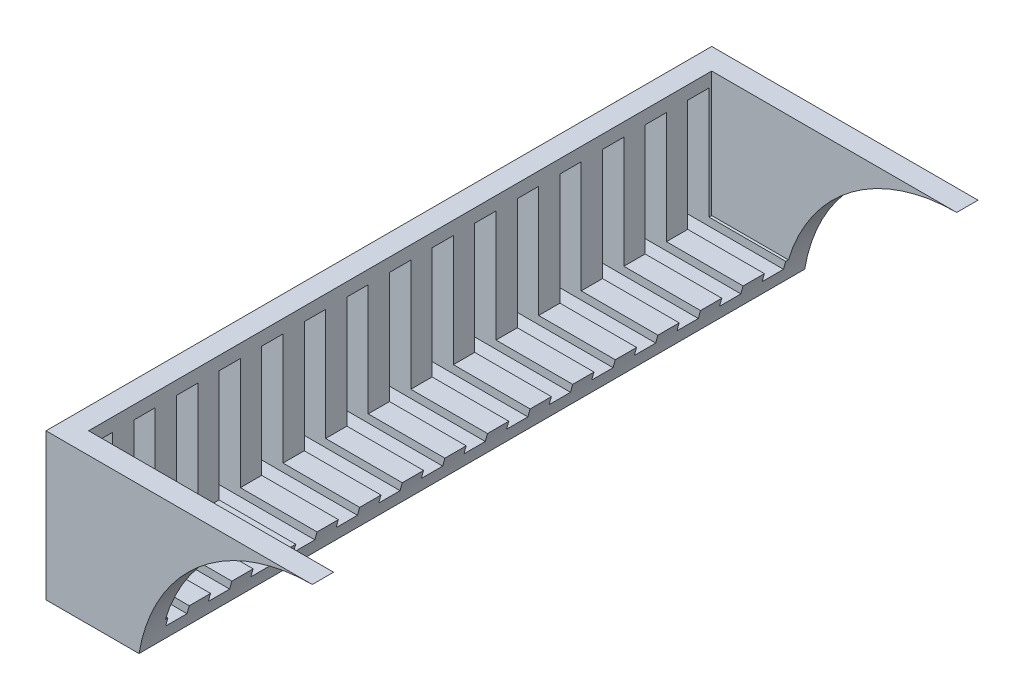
from build123d import *

# Parameters (mm, degrees)
SKETCH1_W               = 127
SKETCH1_H               = 69.85
BOSS_EXTRUDE1_DEPTH     = 317.5
SKETCH2_W               = 116.84
SKETCH2_H               = 297.18
CUT_EXTRUDE1_DEPTH      = 59.69
CUT_EXTRUDE3_DEPTH      = 350.019014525
CUT_EXTRUDE4_REACH      = 351.019
CUT_EXTRUDE4_END_RADIUS = 83.82
SKETCH5_W               = 10.16
SKETCH5_H               = 57.15


with BuildPart() as part:
    # Sketch1 → Boss-Extrude1 (new body)
    with BuildSketch(Plane.XY):
        with Locations((63.5, 34.925)):
            Rectangle(SKETCH1_W, SKETCH1_H)
    extrude(amount=-BOSS_EXTRUDE1_DEPTH)

    # Sketch2 → Cut-Extrude1 (cut)
    with BuildSketch(Plane(origin=(0, 69.85, 0), x_dir=(1, 0, 0), z_dir=(0, 1, 0))):
        with Locations((68.58, 158.75)):
            Rectangle(SKETCH2_W, SKETCH2_H)
    extrude(amount=-CUT_EXTRUDE1_DEPTH, mode=Mode.SUBTRACT)

    # Sketch4 → Cut-Extrude3 (cut, through all)
    with BuildSketch(Plane.XY):
        with BuildLine():
            Line((127, 0), (44.35236543, 0))
            ThreePointArc((44.35236543, 0), (72.894422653, 50.048582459), (127, 69.85))
            Line((127, 69.85), (127, 0))
        make_face()
    extrude(amount=-CUT_EXTRUDE3_DEPTH, mode=Mode.SUBTRACT)

    # Cut-Extrude4: up to this cylinder (the profile starts outside it)
    cut_extrude4_end = Plane(origin=(127, -13.97, -158.75), z_dir=(0, 0, 1)) * Cylinder(CUT_EXTRUDE4_END_RADIUS, 1155.158, mode=Mode.PRIVATE)
    # Sketch5 → Cut-Extrude4 (cut, up to the surface)
    with BuildSketch(Plane.ZY, mode=Mode.PRIVATE) as cut_extrude4_sk1:
        with Locations((-300.99, 34.925)):
            Rectangle(SKETCH5_W, SKETCH5_H)
    cut_extrude4_tool1 = extrude(cut_extrude4_sk1.sketch, amount=-CUT_EXTRUDE4_REACH, mode=Mode.PRIVATE) - cut_extrude4_end
    add(cut_extrude4_tool1.solids().sort_by_distance((0, 34.925, -300.99))[0], mode=Mode.SUBTRACT)
    # Sketch5 → Cut-Extrude4 (cut, up to the surface)
    with BuildSketch(Plane.ZY, mode=Mode.PRIVATE) as cut_extrude4_sk2:
        with Locations((-280.67, 34.925)):
            Rectangle(SKETCH5_W, SKETCH5_H)
    cut_extrude4_tool2 = extrude(cut_extrude4_sk2.sketch, amount=-CUT_EXTRUDE4_REACH, mode=Mode.PRIVATE) - cut_extrude4_end
    add(cut_extrude4_tool2.solids().sort_by_distance((0, 34.925, -280.67))[0], mode=Mode.SUBTRACT)
    # Sketch5 → Cut-Extrude4 (cut, up to the surface)
    with BuildSketch(Plane.ZY, mode=Mode.PRIVATE) as cut_extrude4_sk3:
        with Locations((-260.35, 34.925)):
            Rectangle(SKETCH5_W, SKETCH5_H)
    cut_extrude4_tool3 = extrude(cut_extrude4_sk3.sketch, amount=-CUT_EXTRUDE4_REACH, mode=Mode.PRIVATE) - cut_extrude4_end
    add(cut_extrude4_tool3.solids().sort_by_distance((0, 34.925, -260.35))[0], mode=Mode.SUBTRACT)
    # Sketch5 → Cut-Extrude4 (cut, up to the surface)
    with BuildSketch(Plane.ZY, mode=Mode.PRIVATE) as cut_extrude4_sk4:
        with Locations((-240.03, 34.925)):
            Rectangle(SKETCH5_W, SKETCH5_H)
    cut_extrude4_tool4 = extrude(cut_extrude4_sk4.sketch, amount=-CUT_EXTRUDE4_REACH, mode=Mode.PRIVATE) - cut_extrude4_end
    add(cut_extrude4_tool4.solids().sort_by_distance((0, 34.925, -240.03))[0], mode=Mode.SUBTRACT)
    # Sketch5 → Cut-Extrude4 (cut, up to the surface)
    with BuildSketch(Plane.ZY, mode=Mode.PRIVATE) as cut_extrude4_sk5:
        with Locations((-219.71, 34.925)):
            Rectangle(SKETCH5_W, SKETCH5_H)
    cut_extrude4_tool5 = extrude(cut_extrude4_sk5.sketch, amount=-CUT_EXTRUDE4_REACH, mode=Mode.PRIVATE) - cut_extrude4_end
    add(cut_extrude4_tool5.solids().sort_by_distance((0, 34.925, -219.71))[0], mode=Mode.SUBTRACT)
    # Sketch5 → Cut-Extrude4 (cut, up to the surface)
    with BuildSketch(Plane.ZY, mode=Mode.PRIVATE) as cut_extrude4_sk6:
        with Locations((-199.39, 34.925)):
            Rectangle(SKETCH5_W, SKETCH5_H)
    cut_extrude4_tool6 = extrude(cut_extrude4_sk6.sketch, amount=-CUT_EXTRUDE4_REACH, mode=Mode.PRIVATE) - cut_extrude4_end
    add(cut_extrude4_tool6.solids().sort_by_distance((0, 34.925, -199.39))[0], mode=Mode.SUBTRACT)
    # Sketch5 → Cut-Extrude4 (cut, up to the surface)
    with BuildSketch(Plane.ZY, mode=Mode.PRIVATE) as cut_extrude4_sk7:
        with Locations((-179.07, 34.925)):
            Rectangle(SKETCH5_W, SKETCH5_H)
    cut_extrude4_tool7 = extrude(cut_extrude4_sk7.sketch, amount=-CUT_EXTRUDE4_REACH, mode=Mode.PRIVATE) - cut_extrude4_end
    add(cut_extrude4_tool7.solids().sort_by_distance((0, 34.925, -179.07))[0], mode=Mode.SUBTRACT)
    # Sketch5 → Cut-Extrude4 (cut, up to the surface)
    with BuildSketch(Plane.ZY, mode=Mode.PRIVATE) as cut_extrude4_sk8:
        with Locations((-158.75, 34.925)):
            Rectangle(SKETCH5_W, SKETCH5_H)
    cut_extrude4_tool8 = extrude(cut_extrude4_sk8.sketch, amount=-CUT_EXTRUDE4_REACH, mode=Mode.PRIVATE) - cut_extrude4_end
    add(cut_extrude4_tool8.solids().sort_by_distance((0, 34.925, -158.75))[0], mode=Mode.SUBTRACT)
    # Sketch5 → Cut-Extrude4 (cut, up to the surface)
    with BuildSketch(Plane.ZY, mode=Mode.PRIVATE) as cut_extrude4_sk9:
        with Locations((-138.43, 34.925)):
            Rectangle(SKETCH5_W, SKETCH5_H)
    cut_extrude4_tool9 = extrude(cut_extrude4_sk9.sketch, amount=-CUT_EXTRUDE4_REACH, mode=Mode.PRIVATE) - cut_extrude4_end
    add(cut_extrude4_tool9.solids().sort_by_distance((0, 34.925, -138.43))[0], mode=Mode.SUBTRACT)
    # Sketch5 → Cut-Extrude4 (cut, up to the surface)
    with BuildSketch(Plane.ZY, mode=Mode.PRIVATE) as cut_extrude4_sk10:
        with Locations((-118.11, 34.925)):
            Rectangle(SKETCH5_W, SKETCH5_H)
    cut_extrude4_tool10 = extrude(cut_extrude4_sk10.sketch, amount=-CUT_EXTRUDE4_REACH, mode=Mode.PRIVATE) - cut_extrude4_end
    add(cut_extrude4_tool10.solids().sort_by_distance((0, 34.925, -118.11))[0], mode=Mode.SUBTRACT)
    # Sketch5 → Cut-Extrude4 (cut, up to the surface)
    with BuildSketch(Plane.ZY, mode=Mode.PRIVATE) as cut_extrude4_sk11:
        with Locations((-97.79, 34.925)):
            Rectangle(SKETCH5_W, SKETCH5_H)
    cut_extrude4_tool11 = extrude(cut_extrude4_sk11.sketch, amount=-CUT_EXTRUDE4_REACH, mode=Mode.PRIVATE) - cut_extrude4_end
    add(cut_extrude4_tool11.solids().sort_by_distance((0, 34.925, -97.79))[0], mode=Mode.SUBTRACT)
    # Sketch5 → Cut-Extrude4 (cut, up to the surface)
    with BuildSketch(Plane.ZY, mode=Mode.PRIVATE) as cut_extrude4_sk12:
        with Locations((-77.47, 34.925)):
            Rectangle(SKETCH5_W, SKETCH5_H)
    cut_extrude4_tool12 = extrude(cut_extrude4_sk12.sketch, amount=-CUT_EXTRUDE4_REACH, mode=Mode.PRIVATE) - cut_extrude4_end
    add(cut_extrude4_tool12.solids().sort_by_distance((0, 34.925, -77.47))[0], mode=Mode.SUBTRACT)
    # Sketch5 → Cut-Extrude4 (cut, up to the surface)
    with BuildSketch(Plane.ZY, mode=Mode.PRIVATE) as cut_extrude4_sk13:
        with Locations((-57.15, 34.925)):
            Rectangle(SKETCH5_W, SKETCH5_H)
    cut_extrude4_tool13 = extrude(cut_extrude4_sk13.sketch, amount=-CUT_EXTRUDE4_REACH, mode=Mode.PRIVATE) - cut_extrude4_end
    add(cut_extrude4_tool13.solids().sort_by_distance((0, 34.925, -57.15))[0], mode=Mode.SUBTRACT)
    # Sketch5 → Cut-Extrude4 (cut, up to the surface)
    with BuildSketch(Plane.ZY, mode=Mode.PRIVATE) as cut_extrude4_sk14:
        with Locations((-36.83, 34.925)):
            Rectangle(SKETCH5_W, SKETCH5_H)
    cut_extrude4_tool14 = extrude(cut_extrude4_sk14.sketch, amount=-CUT_EXTRUDE4_REACH, mode=Mode.PRIVATE) - cut_extrude4_end
    add(cut_extrude4_tool14.solids().sort_by_distance((0, 34.925, -36.83))[0], mode=Mode.SUBTRACT)
    # Sketch5 → Cut-Extrude4 (cut, up to the surface)
    with BuildSketch(Plane.ZY, mode=Mode.PRIVATE) as cut_extrude4_sk15:
        with Locations((-16.51, 34.925)):
            Rectangle(SKETCH5_W, SKETCH5_H)
    cut_extrude4_tool15 = extrude(cut_extrude4_sk15.sketch, amount=-CUT_EXTRUDE4_REACH, mode=Mode.PRIVATE) - cut_extrude4_end
    add(cut_extrude4_tool15.solids().sort_by_distance((0, 34.925, -16.51))[0], mode=Mode.SUBTRACT)


solid = part.part
